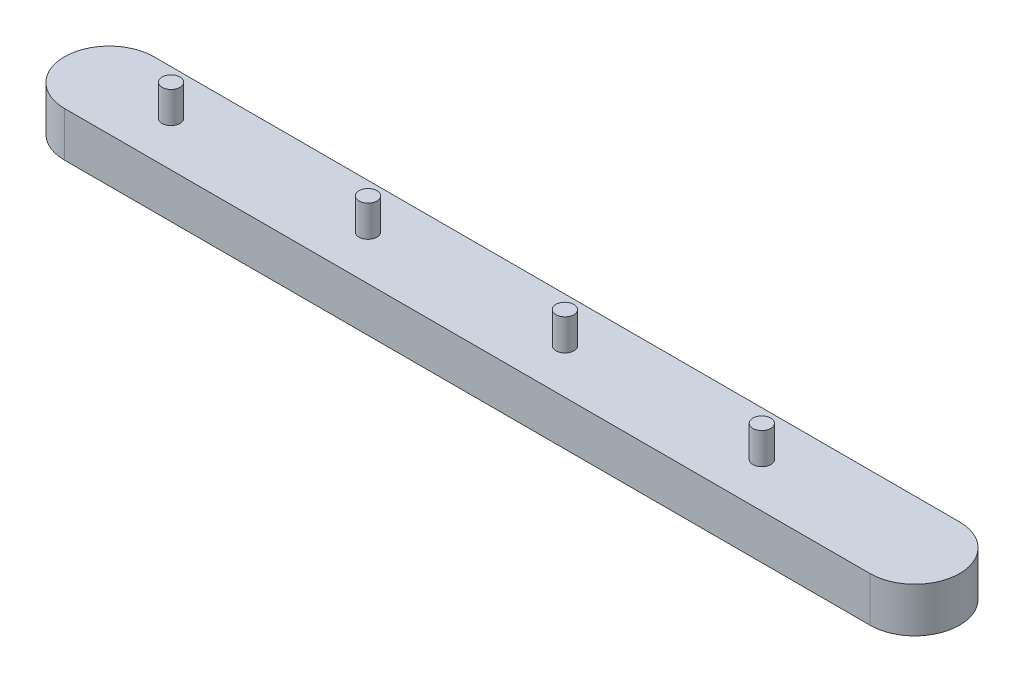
from build123d import *

# Parameters (mm, degrees)
BOSS_EXTRUDE1_DEPTH = 100
SKETCH2_R           = 20
BOSS_EXTRUDE2_DEPTH = 70


with BuildPart() as part:
    # Sketch1 → Boss-Extrude1 (new body)
    with BuildSketch(Plane(origin=(0, 0, 0), x_dir=(1, 0, 0), z_dir=(0, 1, 0))):
        with BuildLine():
            Line((-1056, 100), (744, 100))
            ThreePointArc((744, 100), (844, 0), (744, -100))
            Line((744, -100), (-1056, -100))
            ThreePointArc((-1056, -100), (-1156, 0), (-1056, 100))
        make_face()
    extrude(amount=BOSS_EXTRUDE1_DEPTH)

    # Sketch2 → Boss-Extrude2 (add)
    with BuildSketch(Plane(origin=(0, 100, 0), x_dir=(1, 0, 0), z_dir=(0, 1, 0))):
        with Locations(Location((-917.754269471, 0, 0), (0, 0, 270))):
            Circle(SKETCH2_R)
        with Locations(Location((-477.754269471, 0, 0), (0, 0, 270))):
            Circle(SKETCH2_R)
        with Locations(Location((-37.754269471, 0, 0), (0, 0, 270))):
            Circle(SKETCH2_R)
        with Locations(Location((402.245730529, 0, 0), (0, 0, 270))):
            Circle(SKETCH2_R)
    extrude(amount=BOSS_EXTRUDE2_DEPTH)


solid = part.part
